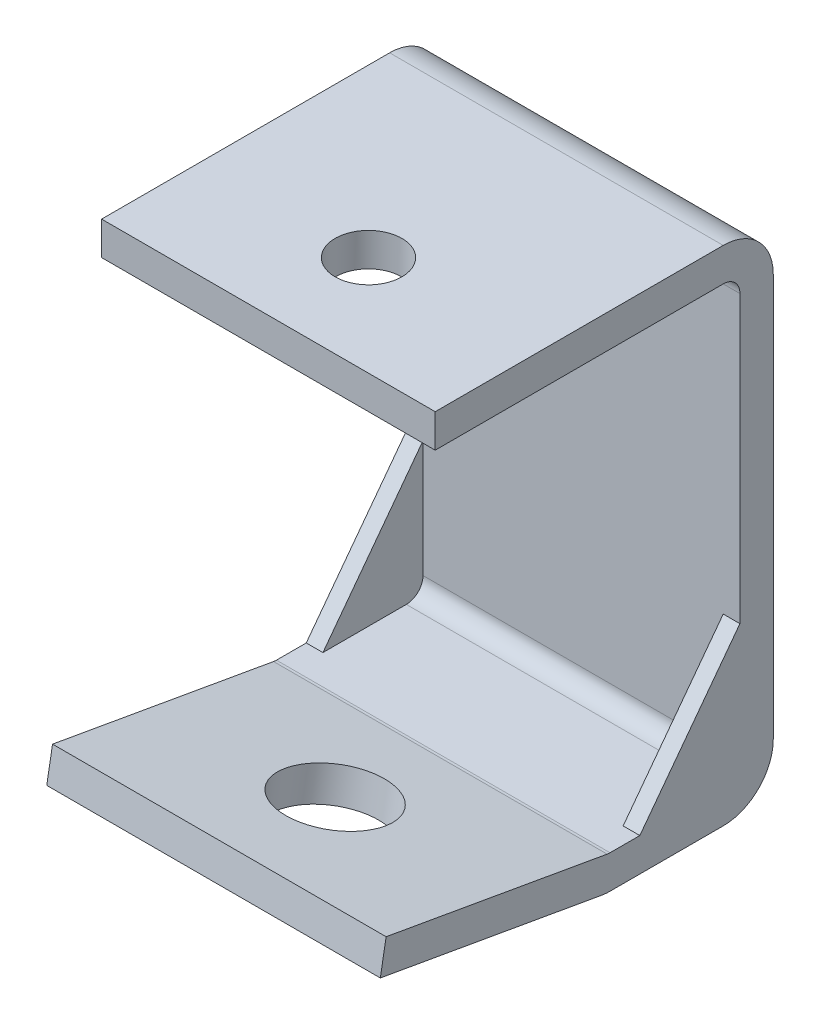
ISO-10303-21;
HEADER;
FILE_DESCRIPTION(('STEP AP214'),'2;1');
FILE_NAME('part.step','',(''),(''),'','','');
FILE_SCHEMA(('AUTOMOTIVE_DESIGN { 1 0 10303 214 1 1 1 1 }'));
ENDSEC;
DATA;
#1=APPLICATION_CONTEXT('core data for automotive mechanical design processes');
#2=APPLICATION_PROTOCOL_DEFINITION('international standard','automotive_design',2000,#1);
#3=PRODUCT_CONTEXT('',#1,'mechanical');
#4=PRODUCT('Part','Part','',(#3));
#5=PRODUCT_RELATED_PRODUCT_CATEGORY('part','',(#4));
#6=PRODUCT_DEFINITION_FORMATION('','',#4);
#7=PRODUCT_DEFINITION_CONTEXT('part definition',#1,'design');
#8=PRODUCT_DEFINITION('design','',#6,#7);
#9=PRODUCT_DEFINITION_SHAPE('','',#8);
#10=(LENGTH_UNIT() NAMED_UNIT(*) SI_UNIT(.MILLI.,.METRE.));
#11=(NAMED_UNIT(*) PLANE_ANGLE_UNIT() SI_UNIT($,.RADIAN.));
#12=(NAMED_UNIT(*) SI_UNIT($,.STERADIAN.) SOLID_ANGLE_UNIT());
#13=UNCERTAINTY_MEASURE_WITH_UNIT(LENGTH_MEASURE(1.E-05),#10,'distance_accuracy_value','');
#14=(GEOMETRIC_REPRESENTATION_CONTEXT(3) GLOBAL_UNCERTAINTY_ASSIGNED_CONTEXT((#13)) GLOBAL_UNIT_ASSIGNED_CONTEXT((#10,
#11,#12)) REPRESENTATION_CONTEXT('',''));
#15=CARTESIAN_POINT('',(0.,0.,0.));
#16=DIRECTION('',(0.,0.,1.));
#17=DIRECTION('',(1.,0.,0.));
#18=AXIS2_PLACEMENT_3D('',#15,#16,#17);
#19=CARTESIAN_POINT('',(31.75,3.175,3.175));
#20=DIRECTION('',(-1.,0.,0.));
#21=DIRECTION('',(0.,0.,1.));
#22=AXIS2_PLACEMENT_3D('',#19,#20,#21);
#23=CYLINDRICAL_SURFACE('',#22,3.175);
#24=DIRECTION('',(-1.,0.,0.));
#25=VECTOR('',#24,1.);
#26=CARTESIAN_POINT('',(31.75,3.175,0.));
#27=LINE('',#26,#25);
#28=CARTESIAN_POINT('',(28.575,3.175,0.));
#29=VERTEX_POINT('',#28);
#30=CARTESIAN_POINT('',(-28.575,3.175,0.));
#31=VERTEX_POINT('',#30);
#32=EDGE_CURVE('E325',#29,#31,#27,.T.);
#33=ORIENTED_EDGE('',*,*,#32,.T.);
#34=CARTESIAN_POINT('',(-28.575,3.175,3.175));
#35=DIRECTION('',(1.,0.,0.));
#36=DIRECTION('',(0.,0.,-1.));
#37=AXIS2_PLACEMENT_3D('',#34,#35,#36);
#38=CIRCLE('',#37,3.175);
#39=CARTESIAN_POINT('',(-28.575,0.,3.175));
#40=VERTEX_POINT('',#39);
#41=EDGE_CURVE('E197',#40,#31,#38,.T.);
#42=ORIENTED_EDGE('',*,*,#41,.F.);
#43=DIRECTION('',(-1.,0.,0.));
#44=VECTOR('',#43,1.);
#45=CARTESIAN_POINT('',(31.75,0.,3.175));
#46=LINE('',#45,#44);
#47=CARTESIAN_POINT('',(28.575,0.,3.175));
#48=VERTEX_POINT('',#47);
#49=EDGE_CURVE('E196',#48,#40,#46,.T.);
#50=ORIENTED_EDGE('',*,*,#49,.F.);
#51=CARTESIAN_POINT('',(28.575,3.175,3.175));
#52=DIRECTION('',(1.,0.,0.));
#53=DIRECTION('',(0.,0.,-1.));
#54=AXIS2_PLACEMENT_3D('',#51,#52,#53);
#55=CIRCLE('',#54,3.175);
#56=EDGE_CURVE('E208',#48,#29,#55,.T.);
#57=ORIENTED_EDGE('',*,*,#56,.T.);
#58=EDGE_LOOP('',(#33,#42,#50,#57));
#59=FACE_BOUND('',#58,.T.);
#60=ADVANCED_FACE('F37',(#59),#23,.F.);
#61=CARTESIAN_POINT('',(31.75,3.175,0.));
#62=DIRECTION('',(0.,0.,1.));
#63=DIRECTION('',(1.,0.,0.));
#64=AXIS2_PLACEMENT_3D('',#61,#62,#63);
#65=PLANE('',#64);
#66=DIRECTION('',(-1.,0.,0.));
#67=VECTOR('',#66,1.);
#68=CARTESIAN_POINT('',(-28.575,25.4,0.));
#69=LINE('',#68,#67);
#70=CARTESIAN_POINT('',(-28.575,25.4,0.));
#71=VERTEX_POINT('',#70);
#72=CARTESIAN_POINT('',(-31.75,25.4,0.));
#73=VERTEX_POINT('',#72);
#74=EDGE_CURVE('E184',#71,#73,#69,.T.);
#75=ORIENTED_EDGE('',*,*,#74,.F.);
#76=DIRECTION('',(0.,1.,0.));
#77=VECTOR('',#76,1.);
#78=CARTESIAN_POINT('',(-28.575,3.175,0.));
#79=LINE('',#78,#77);
#80=EDGE_CURVE('E191',#31,#71,#79,.T.);
#81=ORIENTED_EDGE('',*,*,#80,.F.);
#82=ORIENTED_EDGE('',*,*,#32,.F.);
#83=DIRECTION('',(0.,1.,0.));
#84=VECTOR('',#83,1.);
#85=CARTESIAN_POINT('',(28.575,3.175,0.));
#86=LINE('',#85,#84);
#87=CARTESIAN_POINT('',(28.575,25.4,0.));
#88=VERTEX_POINT('',#87);
#89=EDGE_CURVE('E61',#29,#88,#86,.T.);
#90=ORIENTED_EDGE('',*,*,#89,.T.);
#91=DIRECTION('',(1.,0.,0.));
#92=VECTOR('',#91,1.);
#93=CARTESIAN_POINT('',(28.575,25.4,0.));
#94=LINE('',#93,#92);
#95=CARTESIAN_POINT('',(31.75,25.4,0.));
#96=VERTEX_POINT('',#95);
#97=EDGE_CURVE('E217',#88,#96,#94,.T.);
#98=ORIENTED_EDGE('',*,*,#97,.T.);
#99=DIRECTION('',(0.,1.,0.));
#100=VECTOR('',#99,1.);
#101=CARTESIAN_POINT('',(31.75,3.175,0.));
#102=LINE('',#101,#100);
#103=CARTESIAN_POINT('',(31.75,79.825,0.));
#104=VERTEX_POINT('',#103);
#105=EDGE_CURVE('E238',#96,#104,#102,.T.);
#106=ORIENTED_EDGE('',*,*,#105,.T.);
#107=DIRECTION('',(-1.,0.,0.));
#108=VECTOR('',#107,1.);
#109=CARTESIAN_POINT('',(31.75,79.825,0.));
#110=LINE('',#109,#108);
#111=CARTESIAN_POINT('',(-31.75,79.825,0.));
#112=VERTEX_POINT('',#111);
#113=EDGE_CURVE('E328',#104,#112,#110,.T.);
#114=ORIENTED_EDGE('',*,*,#113,.T.);
#115=DIRECTION('',(0.,1.,0.));
#116=VECTOR('',#115,1.);
#117=CARTESIAN_POINT('',(-31.75,3.175,0.));
#118=LINE('',#117,#116);
#119=EDGE_CURVE('E275',#73,#112,#118,.T.);
#120=ORIENTED_EDGE('',*,*,#119,.F.);
#121=EDGE_LOOP('',(#75,#81,#82,#90,#98,#106,#114,#120));
#122=FACE_BOUND('',#121,.T.);
#123=ADVANCED_FACE('F418',(#122),#65,.T.);
#124=CARTESIAN_POINT('',(31.75,0.,24.7222234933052));
#125=DIRECTION('',(0.,1.,0.));
#126=DIRECTION('',(0.,0.,1.));
#127=AXIS2_PLACEMENT_3D('',#124,#125,#126);
#128=PLANE('',#127);
#129=DIRECTION('',(-1.,0.,0.));
#130=VECTOR('',#129,1.);
#131=CARTESIAN_POINT('',(-28.575,0.,19.05));
#132=LINE('',#131,#130);
#133=CARTESIAN_POINT('',(-28.575,0.,19.05));
#134=VERTEX_POINT('',#133);
#135=CARTESIAN_POINT('',(-31.75,0.,19.05));
#136=VERTEX_POINT('',#135);
#137=EDGE_CURVE('E175',#134,#136,#132,.T.);
#138=ORIENTED_EDGE('',*,*,#137,.T.);
#139=DIRECTION('',(0.,0.,-1.));
#140=VECTOR('',#139,1.);
#141=CARTESIAN_POINT('',(-31.75,0.,24.7222234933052));
#142=LINE('',#141,#140);
#143=CARTESIAN_POINT('',(-31.75,0.,24.7222234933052));
#144=VERTEX_POINT('',#143);
#145=EDGE_CURVE('E277',#144,#136,#142,.T.);
#146=ORIENTED_EDGE('',*,*,#145,.F.);
#147=DIRECTION('',(-1.,0.,0.));
#148=VECTOR('',#147,1.);
#149=CARTESIAN_POINT('',(31.75,0.,24.7222234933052));
#150=LINE('',#149,#148);
#151=CARTESIAN_POINT('',(31.75,0.,24.7222234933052));
#152=VERTEX_POINT('',#151);
#153=EDGE_CURVE('E322',#152,#144,#150,.T.);
#154=ORIENTED_EDGE('',*,*,#153,.F.);
#155=DIRECTION('',(0.,0.,-1.));
#156=VECTOR('',#155,1.);
#157=CARTESIAN_POINT('',(31.75,0.,24.7222234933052));
#158=LINE('',#157,#156);
#159=CARTESIAN_POINT('',(31.75,0.,19.05));
#160=VERTEX_POINT('',#159);
#161=EDGE_CURVE('E240',#152,#160,#158,.T.);
#162=ORIENTED_EDGE('',*,*,#161,.T.);
#163=DIRECTION('',(1.,0.,0.));
#164=VECTOR('',#163,1.);
#165=CARTESIAN_POINT('',(28.575,0.,19.05));
#166=LINE('',#165,#164);
#167=CARTESIAN_POINT('',(28.575,0.,19.05));
#168=VERTEX_POINT('',#167);
#169=EDGE_CURVE('E212',#168,#160,#166,.T.);
#170=ORIENTED_EDGE('',*,*,#169,.F.);
#171=DIRECTION('',(0.,0.,-1.));
#172=VECTOR('',#171,1.);
#173=CARTESIAN_POINT('',(28.575,0.,19.05));
#174=LINE('',#173,#172);
#175=EDGE_CURVE('E210',#168,#48,#174,.T.);
#176=ORIENTED_EDGE('',*,*,#175,.T.);
#177=ORIENTED_EDGE('',*,*,#49,.T.);
#178=DIRECTION('',(0.,0.,-1.));
#179=VECTOR('',#178,1.);
#180=CARTESIAN_POINT('',(-28.575,0.,19.05));
#181=LINE('',#180,#179);
#182=EDGE_CURVE('E188',#134,#40,#181,.T.);
#183=ORIENTED_EDGE('',*,*,#182,.F.);
#184=EDGE_LOOP('',(#138,#146,#154,#162,#170,#176,#177,#183));
#185=FACE_BOUND('',#184,.T.);
#186=ADVANCED_FACE('F194',(#185),#128,.T.);
#187=CARTESIAN_POINT('',(31.75,89.35,3.175));
#188=DIRECTION('',(0.,-1.,0.));
#189=DIRECTION('',(0.,0.,-1.));
#190=AXIS2_PLACEMENT_3D('',#187,#188,#189);
#191=PLANE('',#190);
#192=CARTESIAN_POINT('',(0.,89.35,38.95));
#193=DIRECTION('',(0.,1.,0.));
#194=DIRECTION('',(0.,0.,1.));
#195=AXIS2_PLACEMENT_3D('',#192,#193,#194);
#196=CIRCLE('',#195,6.35);
#197=CARTESIAN_POINT('',(0.,89.35,45.3));
#198=VERTEX_POINT('',#197);
#199=EDGE_CURVE('E222',#198,#198,#196,.T.);
#200=ORIENTED_EDGE('',*,*,#199,.F.);
#201=EDGE_LOOP('',(#200));
#202=FACE_BOUND('',#201,.T.);
#203=DIRECTION('',(0.,0.,1.));
#204=VECTOR('',#203,1.);
#205=CARTESIAN_POINT('',(-31.75,89.35,3.175));
#206=LINE('',#205,#204);
#207=CARTESIAN_POINT('',(-31.75,89.35,3.175));
#208=VERTEX_POINT('',#207);
#209=CARTESIAN_POINT('',(-31.75,89.35,58.));
#210=VERTEX_POINT('',#209);
#211=EDGE_CURVE('E225',#208,#210,#206,.T.);
#212=ORIENTED_EDGE('',*,*,#211,.T.);
#213=DIRECTION('',(-1.,0.,0.));
#214=VECTOR('',#213,1.);
#215=CARTESIAN_POINT('',(31.75,89.35,58.));
#216=LINE('',#215,#214);
#217=CARTESIAN_POINT('',(31.75,89.35,58.));
#218=VERTEX_POINT('',#217);
#219=EDGE_CURVE('E11',#218,#210,#216,.T.);
#220=ORIENTED_EDGE('',*,*,#219,.F.);
#221=DIRECTION('',(0.,0.,1.));
#222=VECTOR('',#221,1.);
#223=CARTESIAN_POINT('',(31.75,89.35,3.175));
#224=LINE('',#223,#222);
#225=CARTESIAN_POINT('',(31.75,89.35,3.175));
#226=VERTEX_POINT('',#225);
#227=EDGE_CURVE('E226',#226,#218,#224,.T.);
#228=ORIENTED_EDGE('',*,*,#227,.F.);
#229=DIRECTION('',(-1.,0.,0.));
#230=VECTOR('',#229,1.);
#231=CARTESIAN_POINT('',(31.75,89.35,3.175));
#232=LINE('',#231,#230);
#233=EDGE_CURVE('E263',#226,#208,#232,.T.);
#234=ORIENTED_EDGE('',*,*,#233,.T.);
#235=EDGE_LOOP('',(#212,#220,#228,#234));
#236=FACE_BOUND('',#235,.T.);
#237=ADVANCED_FACE('F39',(#202,#236),#191,.F.);
#238=CARTESIAN_POINT('',(31.75,83.,58.));
#239=DIRECTION('',(0.,0.,1.));
#240=DIRECTION('',(0.,-1.,0.));
#241=AXIS2_PLACEMENT_3D('',#238,#239,#240);
#242=PLANE('',#241);
#243=DIRECTION('',(0.,1.,0.));
#244=VECTOR('',#243,1.);
#245=CARTESIAN_POINT('',(-31.75,83.,58.));
#246=LINE('',#245,#244);
#247=CARTESIAN_POINT('',(-31.75,83.,58.));
#248=VERTEX_POINT('',#247);
#249=EDGE_CURVE('E266',#248,#210,#246,.T.);
#250=ORIENTED_EDGE('',*,*,#249,.F.);
#251=DIRECTION('',(-1.,0.,0.));
#252=VECTOR('',#251,1.);
#253=CARTESIAN_POINT('',(31.75,83.,58.));
#254=LINE('',#253,#252);
#255=CARTESIAN_POINT('',(31.75,83.,58.));
#256=VERTEX_POINT('',#255);
#257=EDGE_CURVE('E46',#256,#248,#254,.T.);
#258=ORIENTED_EDGE('',*,*,#257,.F.);
#259=DIRECTION('',(0.,1.,0.));
#260=VECTOR('',#259,1.);
#261=CARTESIAN_POINT('',(31.75,83.,58.));
#262=LINE('',#261,#260);
#263=EDGE_CURVE('E228',#256,#218,#262,.T.);
#264=ORIENTED_EDGE('',*,*,#263,.T.);
#265=ORIENTED_EDGE('',*,*,#219,.T.);
#266=EDGE_LOOP('',(#250,#258,#264,#265));
#267=FACE_BOUND('',#266,.T.);
#268=ADVANCED_FACE('F340',(#267),#242,.T.);
#269=CARTESIAN_POINT('',(31.75,83.,3.175));
#270=DIRECTION('',(0.,-1.,0.));
#271=DIRECTION('',(0.,0.,-1.));
#272=AXIS2_PLACEMENT_3D('',#269,#270,#271);
#273=PLANE('',#272);
#274=CARTESIAN_POINT('',(0.,83.,38.95));
#275=DIRECTION('',(0.,-1.,0.));
#276=DIRECTION('',(0.,0.,-1.));
#277=AXIS2_PLACEMENT_3D('',#274,#275,#276);
#278=CIRCLE('',#277,6.35);
#279=CARTESIAN_POINT('',(0.,83.,32.6));
#280=VERTEX_POINT('',#279);
#281=EDGE_CURVE('E219',#280,#280,#278,.F.);
#282=ORIENTED_EDGE('',*,*,#281,.T.);
#283=EDGE_LOOP('',(#282));
#284=FACE_BOUND('',#283,.T.);
#285=DIRECTION('',(0.,0.,1.));
#286=VECTOR('',#285,1.);
#287=CARTESIAN_POINT('',(-31.75,83.,3.175));
#288=LINE('',#287,#286);
#289=CARTESIAN_POINT('',(-31.75,83.,3.175));
#290=VERTEX_POINT('',#289);
#291=EDGE_CURVE('E269',#290,#248,#288,.T.);
#292=ORIENTED_EDGE('',*,*,#291,.F.);
#293=DIRECTION('',(-1.,0.,0.));
#294=VECTOR('',#293,1.);
#295=CARTESIAN_POINT('',(31.75,83.,3.175));
#296=LINE('',#295,#294);
#297=CARTESIAN_POINT('',(31.75,83.,3.175));
#298=VERTEX_POINT('',#297);
#299=EDGE_CURVE('E331',#298,#290,#296,.T.);
#300=ORIENTED_EDGE('',*,*,#299,.F.);
#301=DIRECTION('',(0.,0.,1.));
#302=VECTOR('',#301,1.);
#303=CARTESIAN_POINT('',(31.75,83.,3.175));
#304=LINE('',#303,#302);
#305=EDGE_CURVE('E232',#298,#256,#304,.T.);
#306=ORIENTED_EDGE('',*,*,#305,.T.);
#307=ORIENTED_EDGE('',*,*,#257,.T.);
#308=EDGE_LOOP('',(#292,#300,#306,#307));
#309=FACE_BOUND('',#308,.T.);
#310=ADVANCED_FACE('F336',(#284,#309),#273,.T.);
#311=CARTESIAN_POINT('',(31.75,79.825,3.175));
#312=DIRECTION('',(-1.,0.,0.));
#313=DIRECTION('',(0.,0.,1.));
#314=AXIS2_PLACEMENT_3D('',#311,#312,#313);
#315=CYLINDRICAL_SURFACE('',#314,3.175);
#316=CARTESIAN_POINT('',(-31.75,79.825,3.175));
#317=DIRECTION('',(1.,0.,0.));
#318=DIRECTION('',(0.,0.,-1.));
#319=AXIS2_PLACEMENT_3D('',#316,#317,#318);
#320=CIRCLE('',#319,3.175);
#321=EDGE_CURVE('E272',#112,#290,#320,.T.);
#322=ORIENTED_EDGE('',*,*,#321,.F.);
#323=ORIENTED_EDGE('',*,*,#113,.F.);
#324=CARTESIAN_POINT('',(31.75,79.825,3.175));
#325=DIRECTION('',(1.,0.,0.));
#326=DIRECTION('',(0.,0.,-1.));
#327=AXIS2_PLACEMENT_3D('',#324,#325,#326);
#328=CIRCLE('',#327,3.175);
#329=EDGE_CURVE('E235',#104,#298,#328,.T.);
#330=ORIENTED_EDGE('',*,*,#329,.T.);
#331=ORIENTED_EDGE('',*,*,#299,.T.);
#332=EDGE_LOOP('',(#322,#323,#330,#331));
#333=FACE_BOUND('',#332,.T.);
#334=ADVANCED_FACE('F348',(#333),#315,.F.);
#335=CARTESIAN_POINT('',(31.75,3.175,24.7222234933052));
#336=DIRECTION('',(-1.,0.,0.));
#337=DIRECTION('',(0.,0.,1.));
#338=AXIS2_PLACEMENT_3D('',#335,#336,#337);
#339=CYLINDRICAL_SURFACE('',#338,3.175);
#340=CARTESIAN_POINT('',(-31.75,3.175,24.7222234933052));
#341=DIRECTION('',(1.,0.,0.));
#342=DIRECTION('',(0.,0.,-1.));
#343=AXIS2_PLACEMENT_3D('',#340,#341,#342);
#344=CIRCLE('',#343,3.175);
#345=CARTESIAN_POINT('',(-31.75,0.0482353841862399,25.2735564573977));
#346=VERTEX_POINT('',#345);
#347=EDGE_CURVE('E279',#346,#144,#344,.T.);
#348=ORIENTED_EDGE('',*,*,#347,.F.);
#349=DIRECTION('',(-1.,0.,0.));
#350=VECTOR('',#349,1.);
#351=CARTESIAN_POINT('',(31.75,0.0482353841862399,25.2735564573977));
#352=LINE('',#351,#350);
#353=CARTESIAN_POINT('',(31.75,0.0482353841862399,25.2735564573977));
#354=VERTEX_POINT('',#353);
#355=EDGE_CURVE('E320',#354,#346,#352,.T.);
#356=ORIENTED_EDGE('',*,*,#355,.F.);
#357=CARTESIAN_POINT('',(31.75,3.175,24.7222234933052));
#358=DIRECTION('',(1.,0.,0.));
#359=DIRECTION('',(0.,0.,-1.));
#360=AXIS2_PLACEMENT_3D('',#357,#358,#359);
#361=CIRCLE('',#360,3.175);
#362=EDGE_CURVE('E242',#354,#152,#361,.T.);
#363=ORIENTED_EDGE('',*,*,#362,.T.);
#364=ORIENTED_EDGE('',*,*,#153,.T.);
#365=EDGE_LOOP('',(#348,#356,#363,#364));
#366=FACE_BOUND('',#365,.T.);
#367=ADVANCED_FACE('F395',(#366),#339,.F.);
#368=CARTESIAN_POINT('',(31.75,7.46687163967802,67.3467333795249));
#369=DIRECTION('',(0.,0.984807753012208,-0.173648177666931));
#370=DIRECTION('',(0.,0.173648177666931,0.984807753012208));
#371=AXIS2_PLACEMENT_3D('',#368,#369,#370);
#372=PLANE('',#371);
#373=CARTESIAN_POINT('',(0.,3.58056344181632,45.3063843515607));
#374=DIRECTION('',(0.,0.984807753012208,-0.173648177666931));
#375=DIRECTION('',(0.,0.173648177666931,0.984807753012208));
#376=AXIS2_PLACEMENT_3D('',#373,#374,#375);
#377=CIRCLE('',#376,9.525);
#378=CARTESIAN_POINT('',(0.,5.23456233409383,54.6866781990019));
#379=VERTEX_POINT('',#378);
#380=EDGE_CURVE('E553',#379,#379,#377,.T.);
#381=ORIENTED_EDGE('',*,*,#380,.F.);
#382=EDGE_LOOP('',(#381));
#383=FACE_BOUND('',#382,.T.);
#384=DIRECTION('',(0.,-0.173648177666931,-0.984807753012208));
#385=VECTOR('',#384,1.);
#386=CARTESIAN_POINT('',(-31.75,7.46687163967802,67.3467333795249));
#387=LINE('',#386,#385);
#388=CARTESIAN_POINT('',(-31.75,7.46687163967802,67.3467333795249));
#389=VERTEX_POINT('',#388);
#390=EDGE_CURVE('E282',#389,#346,#387,.T.);
#391=ORIENTED_EDGE('',*,*,#390,.F.);
#392=DIRECTION('',(-1.,0.,0.));
#393=VECTOR('',#392,1.);
#394=CARTESIAN_POINT('',(31.75,7.46687163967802,67.3467333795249));
#395=LINE('',#394,#393);
#396=CARTESIAN_POINT('',(31.75,7.46687163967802,67.3467333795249));
#397=VERTEX_POINT('',#396);
#398=EDGE_CURVE('E318',#397,#389,#395,.T.);
#399=ORIENTED_EDGE('',*,*,#398,.F.);
#400=DIRECTION('',(0.,-0.173648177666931,-0.984807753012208));
#401=VECTOR('',#400,1.);
#402=CARTESIAN_POINT('',(31.75,7.46687163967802,67.3467333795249));
#403=LINE('',#402,#401);
#404=EDGE_CURVE('E245',#397,#354,#403,.T.);
#405=ORIENTED_EDGE('',*,*,#404,.T.);
#406=ORIENTED_EDGE('',*,*,#355,.T.);
#407=EDGE_LOOP('',(#391,#399,#405,#406));
#408=FACE_BOUND('',#407,.T.);
#409=ADVANCED_FACE('F392',(#383,#408),#372,.T.);
#410=CARTESIAN_POINT('',(31.75,1.2133424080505,68.4493993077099));
#411=DIRECTION('',(0.,0.17364817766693,0.984807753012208));
#412=DIRECTION('',(0.,-0.984807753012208,0.17364817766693));
#413=AXIS2_PLACEMENT_3D('',#410,#411,#412);
#414=PLANE('',#413);
#415=DIRECTION('',(0.,0.984807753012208,-0.17364817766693));
#416=VECTOR('',#415,1.);
#417=CARTESIAN_POINT('',(-31.75,1.2133424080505,68.4493993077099));
#418=LINE('',#417,#416);
#419=CARTESIAN_POINT('',(-31.75,1.2133424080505,68.4493993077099));
#420=VERTEX_POINT('',#419);
#421=EDGE_CURVE('E285',#420,#389,#418,.T.);
#422=ORIENTED_EDGE('',*,*,#421,.F.);
#423=DIRECTION('',(-1.,0.,0.));
#424=VECTOR('',#423,1.);
#425=CARTESIAN_POINT('',(31.75,1.2133424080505,68.4493993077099));
#426=LINE('',#425,#424);
#427=CARTESIAN_POINT('',(31.75,1.2133424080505,68.4493993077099));
#428=VERTEX_POINT('',#427);
#429=EDGE_CURVE('E316',#428,#420,#426,.T.);
#430=ORIENTED_EDGE('',*,*,#429,.F.);
#431=DIRECTION('',(0.,0.984807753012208,-0.17364817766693));
#432=VECTOR('',#431,1.);
#433=CARTESIAN_POINT('',(31.75,1.2133424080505,68.4493993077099));
#434=LINE('',#433,#432);
#435=EDGE_CURVE('E248',#428,#397,#434,.T.);
#436=ORIENTED_EDGE('',*,*,#435,.T.);
#437=ORIENTED_EDGE('',*,*,#398,.T.);
#438=EDGE_LOOP('',(#422,#430,#436,#437));
#439=FACE_BOUND('',#438,.T.);
#440=ADVANCED_FACE('F388',(#439),#414,.T.);
#441=CARTESIAN_POINT('',(31.75,1.2133424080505,68.4493993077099));
#442=DIRECTION('',(0.,0.984807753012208,-0.173648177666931));
#443=DIRECTION('',(0.,0.173648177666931,0.984807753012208));
#444=AXIS2_PLACEMENT_3D('',#441,#442,#443);
#445=PLANE('',#444);
#446=CARTESIAN_POINT('',(0.,-2.6729657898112,46.4090502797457));
#447=DIRECTION('',(0.,0.984807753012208,-0.173648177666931));
#448=DIRECTION('',(0.,0.173648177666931,0.984807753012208));
#449=AXIS2_PLACEMENT_3D('',#446,#447,#448);
#450=CIRCLE('',#449,9.525);
#451=CARTESIAN_POINT('',(0.,-1.01896689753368,55.789344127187));
#452=VERTEX_POINT('',#451);
#453=EDGE_CURVE('E41',#452,#452,#450,.T.);
#454=ORIENTED_EDGE('',*,*,#453,.T.);
#455=EDGE_LOOP('',(#454));
#456=FACE_BOUND('',#455,.T.);
#457=DIRECTION('',(0.,-0.173648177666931,-0.984807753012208));
#458=VECTOR('',#457,1.);
#459=CARTESIAN_POINT('',(-31.75,1.2133424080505,68.4493993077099));
#460=LINE('',#459,#458);
#461=CARTESIAN_POINT('',(-31.75,-6.20529384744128,26.3762223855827));
#462=VERTEX_POINT('',#461);
#463=EDGE_CURVE('E288',#420,#462,#460,.T.);
#464=ORIENTED_EDGE('',*,*,#463,.T.);
#465=DIRECTION('',(-1.,0.,0.));
#466=VECTOR('',#465,1.);
#467=CARTESIAN_POINT('',(31.75,-6.20529384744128,26.3762223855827));
#468=LINE('',#467,#466);
#469=CARTESIAN_POINT('',(31.75,-6.20529384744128,26.3762223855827));
#470=VERTEX_POINT('',#469);
#471=EDGE_CURVE('E313',#470,#462,#468,.T.);
#472=ORIENTED_EDGE('',*,*,#471,.F.);
#473=DIRECTION('',(0.,-0.173648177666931,-0.984807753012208));
#474=VECTOR('',#473,1.);
#475=CARTESIAN_POINT('',(31.75,1.2133424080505,68.4493993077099));
#476=LINE('',#475,#474);
#477=EDGE_CURVE('E251',#428,#470,#476,.T.);
#478=ORIENTED_EDGE('',*,*,#477,.F.);
#479=ORIENTED_EDGE('',*,*,#429,.T.);
#480=EDGE_LOOP('',(#464,#472,#478,#479));
#481=FACE_BOUND('',#480,.T.);
#482=ADVANCED_FACE('F384',(#456,#481),#445,.F.);
#483=CARTESIAN_POINT('',(31.75,3.175,24.7222234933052));
#484=DIRECTION('',(-1.,0.,0.));
#485=DIRECTION('',(0.,0.,1.));
#486=AXIS2_PLACEMENT_3D('',#483,#484,#485);
#487=CYLINDRICAL_SURFACE('',#486,9.525);
#488=CARTESIAN_POINT('',(-31.75,3.175,24.7222234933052));
#489=DIRECTION('',(1.,0.,0.));
#490=DIRECTION('',(0.,0.,-1.));
#491=AXIS2_PLACEMENT_3D('',#488,#489,#490);
#492=CIRCLE('',#491,9.525);
#493=CARTESIAN_POINT('',(-31.75,-6.35,24.7222234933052));
#494=VERTEX_POINT('',#493);
#495=EDGE_CURVE('E290',#462,#494,#492,.T.);
#496=ORIENTED_EDGE('',*,*,#495,.T.);
#497=DIRECTION('',(-1.,0.,0.));
#498=VECTOR('',#497,1.);
#499=CARTESIAN_POINT('',(31.75,-6.35,24.7222234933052));
#500=LINE('',#499,#498);
#501=CARTESIAN_POINT('',(31.75,-6.35,24.7222234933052));
#502=VERTEX_POINT('',#501);
#503=EDGE_CURVE('E310',#502,#494,#500,.T.);
#504=ORIENTED_EDGE('',*,*,#503,.F.);
#505=CARTESIAN_POINT('',(31.75,3.175,24.7222234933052));
#506=DIRECTION('',(1.,0.,0.));
#507=DIRECTION('',(0.,0.,-1.));
#508=AXIS2_PLACEMENT_3D('',#505,#506,#507);
#509=CIRCLE('',#508,9.525);
#510=EDGE_CURVE('E253',#470,#502,#509,.T.);
#511=ORIENTED_EDGE('',*,*,#510,.F.);
#512=ORIENTED_EDGE('',*,*,#471,.T.);
#513=EDGE_LOOP('',(#496,#504,#511,#512));
#514=FACE_BOUND('',#513,.T.);
#515=ADVANCED_FACE('F380',(#514),#487,.T.);
#516=CARTESIAN_POINT('',(31.75,-6.35,24.7222234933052));
#517=DIRECTION('',(0.,1.,0.));
#518=DIRECTION('',(0.,0.,1.));
#519=AXIS2_PLACEMENT_3D('',#516,#517,#518);
#520=PLANE('',#519);
#521=DIRECTION('',(0.,0.,-1.));
#522=VECTOR('',#521,1.);
#523=CARTESIAN_POINT('',(-31.75,-6.35,24.7222234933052));
#524=LINE('',#523,#522);
#525=CARTESIAN_POINT('',(-31.75,-6.35,3.175));
#526=VERTEX_POINT('',#525);
#527=EDGE_CURVE('E292',#494,#526,#524,.T.);
#528=ORIENTED_EDGE('',*,*,#527,.T.);
#529=DIRECTION('',(-1.,0.,0.));
#530=VECTOR('',#529,1.);
#531=CARTESIAN_POINT('',(31.75,-6.35,3.175));
#532=LINE('',#531,#530);
#533=CARTESIAN_POINT('',(31.75,-6.35,3.175));
#534=VERTEX_POINT('',#533);
#535=EDGE_CURVE('E307',#534,#526,#532,.T.);
#536=ORIENTED_EDGE('',*,*,#535,.F.);
#537=DIRECTION('',(0.,0.,-1.));
#538=VECTOR('',#537,1.);
#539=CARTESIAN_POINT('',(31.75,-6.35,24.7222234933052));
#540=LINE('',#539,#538);
#541=EDGE_CURVE('E255',#502,#534,#540,.T.);
#542=ORIENTED_EDGE('',*,*,#541,.F.);
#543=ORIENTED_EDGE('',*,*,#503,.T.);
#544=EDGE_LOOP('',(#528,#536,#542,#543));
#545=FACE_BOUND('',#544,.T.);
#546=ADVANCED_FACE('F375',(#545),#520,.F.);
#547=CARTESIAN_POINT('',(31.75,3.175,3.175));
#548=DIRECTION('',(-1.,0.,0.));
#549=DIRECTION('',(0.,0.,1.));
#550=AXIS2_PLACEMENT_3D('',#547,#548,#549);
#551=CYLINDRICAL_SURFACE('',#550,9.525);
#552=CARTESIAN_POINT('',(-31.75,3.175,3.175));
#553=DIRECTION('',(1.,0.,0.));
#554=DIRECTION('',(0.,0.,-1.));
#555=AXIS2_PLACEMENT_3D('',#552,#553,#554);
#556=CIRCLE('',#555,9.525);
#557=CARTESIAN_POINT('',(-31.75,3.175,-6.35));
#558=VERTEX_POINT('',#557);
#559=EDGE_CURVE('E294',#526,#558,#556,.T.);
#560=ORIENTED_EDGE('',*,*,#559,.T.);
#561=DIRECTION('',(-1.,0.,0.));
#562=VECTOR('',#561,1.);
#563=CARTESIAN_POINT('',(31.75,3.175,-6.35));
#564=LINE('',#563,#562);
#565=CARTESIAN_POINT('',(31.75,3.175,-6.35));
#566=VERTEX_POINT('',#565);
#567=EDGE_CURVE('E304',#566,#558,#564,.T.);
#568=ORIENTED_EDGE('',*,*,#567,.F.);
#569=CARTESIAN_POINT('',(31.75,3.175,3.175));
#570=DIRECTION('',(1.,0.,0.));
#571=DIRECTION('',(0.,0.,-1.));
#572=AXIS2_PLACEMENT_3D('',#569,#570,#571);
#573=CIRCLE('',#572,9.525);
#574=EDGE_CURVE('E257',#534,#566,#573,.T.);
#575=ORIENTED_EDGE('',*,*,#574,.F.);
#576=ORIENTED_EDGE('',*,*,#535,.T.);
#577=EDGE_LOOP('',(#560,#568,#575,#576));
#578=FACE_BOUND('',#577,.T.);
#579=ADVANCED_FACE('F369',(#578),#551,.T.);
#580=CARTESIAN_POINT('',(31.75,3.175,-6.35));
#581=DIRECTION('',(0.,0.,1.));
#582=DIRECTION('',(1.,0.,0.));
#583=AXIS2_PLACEMENT_3D('',#580,#581,#582);
#584=PLANE('',#583);
#585=DIRECTION('',(0.,1.,0.));
#586=VECTOR('',#585,1.);
#587=CARTESIAN_POINT('',(-31.75,3.175,-6.35));
#588=LINE('',#587,#586);
#589=CARTESIAN_POINT('',(-31.75,79.825,-6.35));
#590=VERTEX_POINT('',#589);
#591=EDGE_CURVE('E296',#558,#590,#588,.T.);
#592=ORIENTED_EDGE('',*,*,#591,.T.);
#593=DIRECTION('',(-1.,0.,0.));
#594=VECTOR('',#593,1.);
#595=CARTESIAN_POINT('',(31.75,79.825,-6.35));
#596=LINE('',#595,#594);
#597=CARTESIAN_POINT('',(31.75,79.825,-6.35));
#598=VERTEX_POINT('',#597);
#599=EDGE_CURVE('E301',#598,#590,#596,.T.);
#600=ORIENTED_EDGE('',*,*,#599,.F.);
#601=DIRECTION('',(0.,1.,0.));
#602=VECTOR('',#601,1.);
#603=CARTESIAN_POINT('',(31.75,3.175,-6.35));
#604=LINE('',#603,#602);
#605=EDGE_CURVE('E259',#566,#598,#604,.T.);
#606=ORIENTED_EDGE('',*,*,#605,.F.);
#607=ORIENTED_EDGE('',*,*,#567,.T.);
#608=EDGE_LOOP('',(#592,#600,#606,#607));
#609=FACE_BOUND('',#608,.T.);
#610=ADVANCED_FACE('F365',(#609),#584,.F.);
#611=CARTESIAN_POINT('',(31.75,79.825,3.175));
#612=DIRECTION('',(-1.,0.,0.));
#613=DIRECTION('',(0.,0.,1.));
#614=AXIS2_PLACEMENT_3D('',#611,#612,#613);
#615=CYLINDRICAL_SURFACE('',#614,9.525);
#616=CARTESIAN_POINT('',(-31.75,79.825,3.175));
#617=DIRECTION('',(1.,0.,0.));
#618=DIRECTION('',(0.,0.,-1.));
#619=AXIS2_PLACEMENT_3D('',#616,#617,#618);
#620=CIRCLE('',#619,9.525);
#621=EDGE_CURVE('E229',#590,#208,#620,.T.);
#622=ORIENTED_EDGE('',*,*,#621,.T.);
#623=ORIENTED_EDGE('',*,*,#233,.F.);
#624=CARTESIAN_POINT('',(31.75,79.825,3.175));
#625=DIRECTION('',(1.,0.,0.));
#626=DIRECTION('',(0.,0.,-1.));
#627=AXIS2_PLACEMENT_3D('',#624,#625,#626);
#628=CIRCLE('',#627,9.525);
#629=EDGE_CURVE('E261',#598,#226,#628,.T.);
#630=ORIENTED_EDGE('',*,*,#629,.F.);
#631=ORIENTED_EDGE('',*,*,#599,.T.);
#632=EDGE_LOOP('',(#622,#623,#630,#631));
#633=FACE_BOUND('',#632,.T.);
#634=ADVANCED_FACE('F361',(#633),#615,.T.);
#635=CARTESIAN_POINT('',(31.75,79.825,3.175));
#636=DIRECTION('',(1.,0.,0.));
#637=DIRECTION('',(0.,0.,-1.));
#638=AXIS2_PLACEMENT_3D('',#635,#636,#637);
#639=PLANE('',#638);
#640=ORIENTED_EDGE('',*,*,#105,.F.);
#641=DIRECTION('',(0.,0.8,-0.6));
#642=VECTOR('',#641,1.);
#643=CARTESIAN_POINT('',(31.75,0.,19.05));
#644=LINE('',#643,#642);
#645=EDGE_CURVE('E183',#160,#96,#644,.T.);
#646=ORIENTED_EDGE('',*,*,#645,.F.);
#647=ORIENTED_EDGE('',*,*,#161,.F.);
#648=ORIENTED_EDGE('',*,*,#362,.F.);
#649=ORIENTED_EDGE('',*,*,#404,.F.);
#650=ORIENTED_EDGE('',*,*,#435,.F.);
#651=ORIENTED_EDGE('',*,*,#477,.T.);
#652=ORIENTED_EDGE('',*,*,#510,.T.);
#653=ORIENTED_EDGE('',*,*,#541,.T.);
#654=ORIENTED_EDGE('',*,*,#574,.T.);
#655=ORIENTED_EDGE('',*,*,#605,.T.);
#656=ORIENTED_EDGE('',*,*,#629,.T.);
#657=ORIENTED_EDGE('',*,*,#227,.T.);
#658=ORIENTED_EDGE('',*,*,#263,.F.);
#659=ORIENTED_EDGE('',*,*,#305,.F.);
#660=ORIENTED_EDGE('',*,*,#329,.F.);
#661=EDGE_LOOP('',(#640,#646,#647,#648,#649,#650,#651,#652,#653,#654,#655,#656,#657,#658,#659,#660));
#662=FACE_BOUND('',#661,.T.);
#663=ADVANCED_FACE('F352',(#662),#639,.T.);
#664=CARTESIAN_POINT('',(-31.75,79.825,3.175));
#665=DIRECTION('',(1.,0.,0.));
#666=DIRECTION('',(0.,0.,-1.));
#667=AXIS2_PLACEMENT_3D('',#664,#665,#666);
#668=PLANE('',#667);
#669=ORIENTED_EDGE('',*,*,#211,.F.);
#670=ORIENTED_EDGE('',*,*,#621,.F.);
#671=ORIENTED_EDGE('',*,*,#591,.F.);
#672=ORIENTED_EDGE('',*,*,#559,.F.);
#673=ORIENTED_EDGE('',*,*,#527,.F.);
#674=ORIENTED_EDGE('',*,*,#495,.F.);
#675=ORIENTED_EDGE('',*,*,#463,.F.);
#676=ORIENTED_EDGE('',*,*,#421,.T.);
#677=ORIENTED_EDGE('',*,*,#390,.T.);
#678=ORIENTED_EDGE('',*,*,#347,.T.);
#679=ORIENTED_EDGE('',*,*,#145,.T.);
#680=DIRECTION('',(0.,0.8,-0.6));
#681=VECTOR('',#680,1.);
#682=CARTESIAN_POINT('',(-31.75,0.,19.05));
#683=LINE('',#682,#681);
#684=EDGE_CURVE('E53',#136,#73,#683,.T.);
#685=ORIENTED_EDGE('',*,*,#684,.T.);
#686=ORIENTED_EDGE('',*,*,#119,.T.);
#687=ORIENTED_EDGE('',*,*,#321,.T.);
#688=ORIENTED_EDGE('',*,*,#291,.T.);
#689=ORIENTED_EDGE('',*,*,#249,.T.);
#690=EDGE_LOOP('',(#669,#670,#671,#672,#673,#674,#675,#676,#677,#678,#679,#685,#686,#687,#688,#689));
#691=FACE_BOUND('',#690,.T.);
#692=ADVANCED_FACE('F343',(#691),#668,.F.);
#693=CARTESIAN_POINT('',(0.,-6.35100000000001,38.9500000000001));
#694=DIRECTION('',(0.,1.,0.));
#695=DIRECTION('',(0.,0.,1.));
#696=AXIS2_PLACEMENT_3D('',#693,#694,#695);
#697=CYLINDRICAL_SURFACE('',#696,6.35);
#698=ORIENTED_EDGE('',*,*,#281,.F.);
#699=EDGE_LOOP('',(#698));
#700=FACE_BOUND('',#699,.T.);
#701=ORIENTED_EDGE('',*,*,#199,.T.);
#702=EDGE_LOOP('',(#701));
#703=FACE_BOUND('',#702,.T.);
#704=ADVANCED_FACE('F416',(#700,#703),#697,.F.);
#705=CARTESIAN_POINT('',(28.575,0.,19.05));
#706=DIRECTION('',(0.,-0.6,-0.8));
#707=DIRECTION('',(0.,0.8,-0.6));
#708=AXIS2_PLACEMENT_3D('',#705,#706,#707);
#709=PLANE('',#708);
#710=ORIENTED_EDGE('',*,*,#645,.T.);
#711=ORIENTED_EDGE('',*,*,#97,.F.);
#712=DIRECTION('',(0.,0.8,-0.6));
#713=VECTOR('',#712,1.);
#714=CARTESIAN_POINT('',(28.575,0.,19.05));
#715=LINE('',#714,#713);
#716=EDGE_CURVE('E205',#168,#88,#715,.T.);
#717=ORIENTED_EDGE('',*,*,#716,.F.);
#718=ORIENTED_EDGE('',*,*,#169,.T.);
#719=EDGE_LOOP('',(#710,#711,#717,#718));
#720=FACE_BOUND('',#719,.T.);
#721=ADVANCED_FACE('F401',(#720),#709,.F.);
#722=CARTESIAN_POINT('',(28.575,3.175,3.175));
#723=DIRECTION('',(1.,0.,0.));
#724=DIRECTION('',(0.,0.,-1.));
#725=AXIS2_PLACEMENT_3D('',#722,#723,#724);
#726=PLANE('',#725);
#727=ORIENTED_EDGE('',*,*,#716,.T.);
#728=ORIENTED_EDGE('',*,*,#89,.F.);
#729=ORIENTED_EDGE('',*,*,#56,.F.);
#730=ORIENTED_EDGE('',*,*,#175,.F.);
#731=EDGE_LOOP('',(#727,#728,#729,#730));
#732=FACE_BOUND('',#731,.T.);
#733=ADVANCED_FACE('F407',(#732),#726,.F.);
#734=CARTESIAN_POINT('',(-28.575,0.,19.05));
#735=DIRECTION('',(0.,0.6,0.8));
#736=DIRECTION('',(0.,-0.8,0.6));
#737=AXIS2_PLACEMENT_3D('',#734,#735,#736);
#738=PLANE('',#737);
#739=ORIENTED_EDGE('',*,*,#684,.F.);
#740=ORIENTED_EDGE('',*,*,#137,.F.);
#741=DIRECTION('',(0.,0.8,-0.6));
#742=VECTOR('',#741,1.);
#743=CARTESIAN_POINT('',(-28.575,0.,19.05));
#744=LINE('',#743,#742);
#745=EDGE_CURVE('E178',#134,#71,#744,.T.);
#746=ORIENTED_EDGE('',*,*,#745,.T.);
#747=ORIENTED_EDGE('',*,*,#74,.T.);
#748=EDGE_LOOP('',(#739,#740,#746,#747));
#749=FACE_BOUND('',#748,.T.);
#750=ADVANCED_FACE('F177',(#749),#738,.T.);
#751=CARTESIAN_POINT('',(-28.575,3.175,3.175));
#752=DIRECTION('',(-1.,0.,0.));
#753=DIRECTION('',(0.,0.,-1.));
#754=AXIS2_PLACEMENT_3D('',#751,#752,#753);
#755=PLANE('',#754);
#756=ORIENTED_EDGE('',*,*,#745,.F.);
#757=ORIENTED_EDGE('',*,*,#182,.T.);
#758=ORIENTED_EDGE('',*,*,#41,.T.);
#759=ORIENTED_EDGE('',*,*,#80,.T.);
#760=EDGE_LOOP('',(#756,#757,#758,#759));
#761=FACE_BOUND('',#760,.T.);
#762=ADVANCED_FACE('F187',(#761),#755,.F.);
#763=CARTESIAN_POINT('',(0.,-10.0082455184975,47.7024580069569));
#764=DIRECTION('',(0.,0.984807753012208,-0.173648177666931));
#765=DIRECTION('',(0.,0.173648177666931,0.984807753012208));
#766=AXIS2_PLACEMENT_3D('',#763,#764,#765);
#767=CYLINDRICAL_SURFACE('',#766,9.525);
#768=ORIENTED_EDGE('',*,*,#380,.T.);
#769=EDGE_LOOP('',(#768));
#770=FACE_BOUND('',#769,.T.);
#771=ORIENTED_EDGE('',*,*,#453,.F.);
#772=EDGE_LOOP('',(#771));
#773=FACE_BOUND('',#772,.T.);
#774=ADVANCED_FACE('F533',(#770,#773),#767,.F.);
#775=CLOSED_SHELL('',(#60,#123,#186,#237,#268,#310,#334,#367,#409,#440,#482,#515,#546,#579,#610,
#634,#663,#692,#704,#721,#733,#750,#762,#774));
#776=MANIFOLD_SOLID_BREP('B2',#775);
#777=ADVANCED_BREP_SHAPE_REPRESENTATION('',(#18,#776),#14);
#778=SHAPE_DEFINITION_REPRESENTATION(#9,#777);
ENDSEC;
END-ISO-10303-21;
